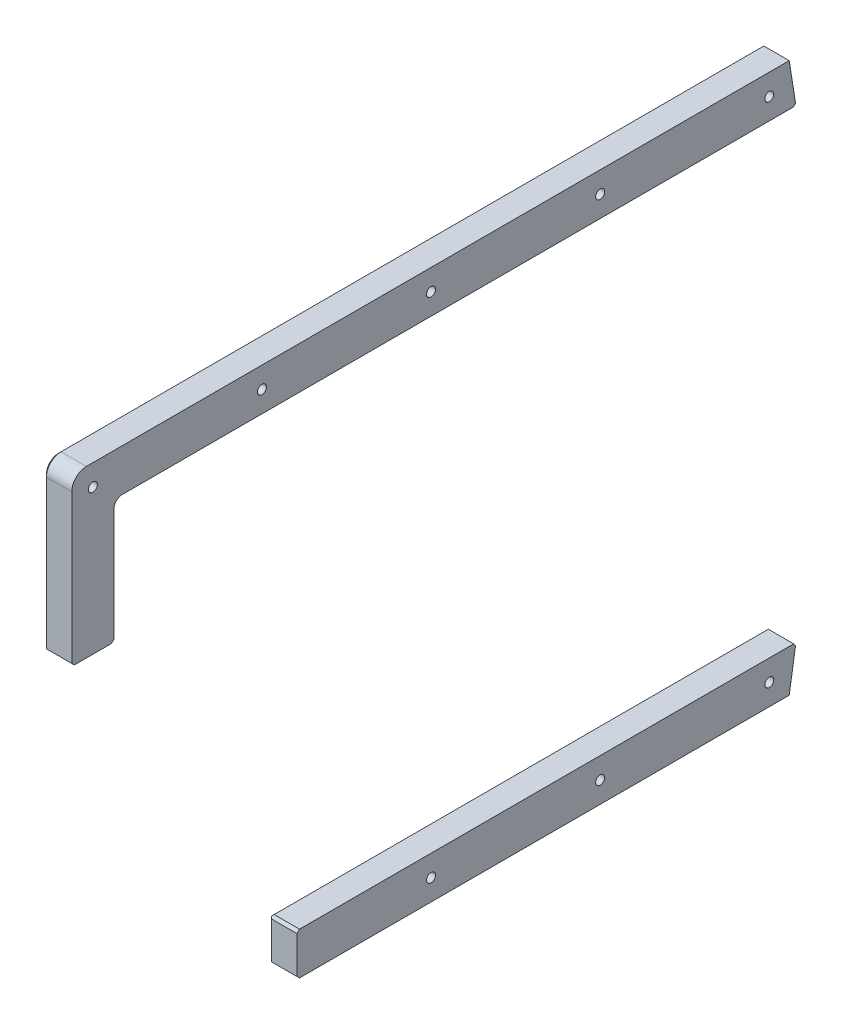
ISO-10303-21;
HEADER;
FILE_DESCRIPTION(('STEP AP214'),'2;1');
FILE_NAME('part.step','',(''),(''),'','','');
FILE_SCHEMA(('AUTOMOTIVE_DESIGN { 1 0 10303 214 1 1 1 1 }'));
ENDSEC;
DATA;
#1=APPLICATION_CONTEXT('core data for automotive mechanical design processes');
#2=APPLICATION_PROTOCOL_DEFINITION('international standard','automotive_design',2000,#1);
#3=PRODUCT_CONTEXT('',#1,'mechanical');
#4=PRODUCT('Part','Part','',(#3));
#5=PRODUCT_RELATED_PRODUCT_CATEGORY('part','',(#4));
#6=PRODUCT_DEFINITION_FORMATION('','',#4);
#7=PRODUCT_DEFINITION_CONTEXT('part definition',#1,'design');
#8=PRODUCT_DEFINITION('design','',#6,#7);
#9=PRODUCT_DEFINITION_SHAPE('','',#8);
#10=(LENGTH_UNIT() NAMED_UNIT(*) SI_UNIT(.MILLI.,.METRE.));
#11=(NAMED_UNIT(*) PLANE_ANGLE_UNIT() SI_UNIT($,.RADIAN.));
#12=(NAMED_UNIT(*) SI_UNIT($,.STERADIAN.) SOLID_ANGLE_UNIT());
#13=UNCERTAINTY_MEASURE_WITH_UNIT(LENGTH_MEASURE(1.E-05),#10,'distance_accuracy_value','');
#14=(GEOMETRIC_REPRESENTATION_CONTEXT(3) GLOBAL_UNCERTAINTY_ASSIGNED_CONTEXT((#13)) GLOBAL_UNIT_ASSIGNED_CONTEXT((#10,
#11,#12)) REPRESENTATION_CONTEXT('',''));
#15=CARTESIAN_POINT('',(0.,0.,0.));
#16=DIRECTION('',(0.,0.,1.));
#17=DIRECTION('',(1.,0.,0.));
#18=AXIS2_PLACEMENT_3D('',#15,#16,#17);
#19=CARTESIAN_POINT('',(0.,-44.7506615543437,-62.176880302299));
#20=DIRECTION('',(0.,0.,-1.));
#21=DIRECTION('',(-1.,0.,0.));
#22=AXIS2_PLACEMENT_3D('',#19,#20,#21);
#23=PLANE('',#22);
#24=DIRECTION('',(0.,-1.,0.));
#25=VECTOR('',#24,1.);
#26=CARTESIAN_POINT('',(8.382,103.255138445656,-62.176880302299));
#27=LINE('',#26,#25);
#28=CARTESIAN_POINT('',(8.382,-45.5126615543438,-62.176880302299));
#29=VERTEX_POINT('',#28);
#30=CARTESIAN_POINT('',(8.382,-56.6886615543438,-62.176880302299));
#31=VERTEX_POINT('',#30);
#32=EDGE_CURVE('E187',#29,#31,#27,.T.);
#33=ORIENTED_EDGE('',*,*,#32,.F.);
#34=DIRECTION('',(-1.,0.,0.));
#35=VECTOR('',#34,1.);
#36=CARTESIAN_POINT('',(0.,-45.5126615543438,-62.176880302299));
#37=LINE('',#36,#35);
#38=CARTESIAN_POINT('',(0.761999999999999,-45.5126615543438,-62.176880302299));
#39=VERTEX_POINT('',#38);
#40=EDGE_CURVE('E220',#29,#39,#37,.T.);
#41=ORIENTED_EDGE('',*,*,#40,.T.);
#42=DIRECTION('',(0.,-1.,0.));
#43=VECTOR('',#42,1.);
#44=CARTESIAN_POINT('',(0.761999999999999,-56.6886615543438,-62.176880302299));
#45=LINE('',#44,#43);
#46=CARTESIAN_POINT('',(0.761999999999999,-56.6886615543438,-62.176880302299));
#47=VERTEX_POINT('',#46);
#48=EDGE_CURVE('E218',#39,#47,#45,.T.);
#49=ORIENTED_EDGE('',*,*,#48,.T.);
#50=DIRECTION('',(1.,0.,0.));
#51=VECTOR('',#50,1.);
#52=CARTESIAN_POINT('',(0.,-56.6886615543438,-62.176880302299));
#53=LINE('',#52,#51);
#54=EDGE_CURVE('E216',#47,#31,#53,.T.);
#55=ORIENTED_EDGE('',*,*,#54,.T.);
#56=EDGE_LOOP('',(#33,#41,#49,#55));
#57=FACE_BOUND('',#56,.T.);
#58=ADVANCED_FACE('F49',(#57),#23,.F.);
#59=CARTESIAN_POINT('',(8.382,-51.1006615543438,-153.268880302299));
#60=DIRECTION('',(-1.,0.,0.));
#61=DIRECTION('',(0.,0.,1.));
#62=AXIS2_PLACEMENT_3D('',#59,#60,#61);
#63=CYLINDRICAL_SURFACE('',#62,1.35255);
#64=CARTESIAN_POINT('',(8.382,-51.1006615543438,-153.268880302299));
#65=DIRECTION('',(1.,0.,0.));
#66=DIRECTION('',(0.,0.,-1.));
#67=AXIS2_PLACEMENT_3D('',#64,#65,#66);
#68=CIRCLE('',#67,1.35255);
#69=CARTESIAN_POINT('',(8.382,-51.1006615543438,-154.621430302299));
#70=VERTEX_POINT('',#69);
#71=EDGE_CURVE('E196',#70,#70,#68,.T.);
#72=ORIENTED_EDGE('',*,*,#71,.T.);
#73=EDGE_LOOP('',(#72));
#74=FACE_BOUND('',#73,.T.);
#75=CARTESIAN_POINT('',(0.,-51.1006615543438,-153.268880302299));
#76=DIRECTION('',(1.,0.,0.));
#77=DIRECTION('',(0.,0.,-1.));
#78=AXIS2_PLACEMENT_3D('',#75,#76,#77);
#79=CIRCLE('',#78,1.35255);
#80=CARTESIAN_POINT('',(0.,-51.1006615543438,-154.621430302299));
#81=VERTEX_POINT('',#80);
#82=EDGE_CURVE('E191',#81,#81,#79,.T.);
#83=ORIENTED_EDGE('',*,*,#82,.F.);
#84=EDGE_LOOP('',(#83));
#85=FACE_BOUND('',#84,.T.);
#86=ADVANCED_FACE('F275',(#74,#85),#63,.F.);
#87=CARTESIAN_POINT('',(8.382,-51.1006615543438,-204.068880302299));
#88=DIRECTION('',(-1.,0.,0.));
#89=DIRECTION('',(0.,0.,1.));
#90=AXIS2_PLACEMENT_3D('',#87,#88,#89);
#91=CYLINDRICAL_SURFACE('',#90,1.35255);
#92=CARTESIAN_POINT('',(8.382,-51.1006615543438,-204.068880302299));
#93=DIRECTION('',(1.,0.,0.));
#94=DIRECTION('',(0.,0.,-1.));
#95=AXIS2_PLACEMENT_3D('',#92,#93,#94);
#96=CIRCLE('',#95,1.35255);
#97=CARTESIAN_POINT('',(8.382,-51.1006615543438,-205.421430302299));
#98=VERTEX_POINT('',#97);
#99=EDGE_CURVE('E199',#98,#98,#96,.T.);
#100=ORIENTED_EDGE('',*,*,#99,.T.);
#101=EDGE_LOOP('',(#100));
#102=FACE_BOUND('',#101,.T.);
#103=CARTESIAN_POINT('',(0.,-51.1006615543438,-204.068880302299));
#104=DIRECTION('',(1.,0.,0.));
#105=DIRECTION('',(0.,0.,-1.));
#106=AXIS2_PLACEMENT_3D('',#103,#104,#105);
#107=CIRCLE('',#106,1.35255);
#108=CARTESIAN_POINT('',(0.,-51.1006615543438,-205.421430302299));
#109=VERTEX_POINT('',#108);
#110=EDGE_CURVE('E195',#109,#109,#107,.T.);
#111=ORIENTED_EDGE('',*,*,#110,.F.);
#112=EDGE_LOOP('',(#111));
#113=FACE_BOUND('',#112,.T.);
#114=ADVANCED_FACE('F280',(#102,#113),#91,.F.);
#115=CARTESIAN_POINT('',(8.382,-51.1006615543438,-102.468880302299));
#116=DIRECTION('',(-1.,0.,0.));
#117=DIRECTION('',(0.,0.,1.));
#118=AXIS2_PLACEMENT_3D('',#115,#116,#117);
#119=CYLINDRICAL_SURFACE('',#118,1.35255);
#120=CARTESIAN_POINT('',(8.382,-51.1006615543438,-102.468880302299));
#121=DIRECTION('',(1.,0.,0.));
#122=DIRECTION('',(0.,0.,-1.));
#123=AXIS2_PLACEMENT_3D('',#120,#121,#122);
#124=CIRCLE('',#123,1.35255);
#125=CARTESIAN_POINT('',(8.382,-51.1006615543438,-103.821430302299));
#126=VERTEX_POINT('',#125);
#127=EDGE_CURVE('E139',#126,#126,#124,.T.);
#128=ORIENTED_EDGE('',*,*,#127,.T.);
#129=EDGE_LOOP('',(#128));
#130=FACE_BOUND('',#129,.T.);
#131=CARTESIAN_POINT('',(0.,-51.1006615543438,-102.468880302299));
#132=DIRECTION('',(1.,0.,0.));
#133=DIRECTION('',(0.,0.,-1.));
#134=AXIS2_PLACEMENT_3D('',#131,#132,#133);
#135=CIRCLE('',#134,1.35255);
#136=CARTESIAN_POINT('',(0.,-51.1006615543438,-103.821430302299));
#137=VERTEX_POINT('',#136);
#138=EDGE_CURVE('E181',#137,#137,#135,.T.);
#139=ORIENTED_EDGE('',*,*,#138,.F.);
#140=EDGE_LOOP('',(#139));
#141=FACE_BOUND('',#140,.T.);
#142=ADVANCED_FACE('F284',(#130,#141),#119,.F.);
#143=CARTESIAN_POINT('',(8.382,-44.7506615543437,-211.40976580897));
#144=DIRECTION('',(0.,-0.587724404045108,0.809061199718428));
#145=DIRECTION('',(-1.,0.,0.));
#146=AXIS2_PLACEMENT_3D('',#143,#144,#145);
#147=PLANE('',#146);
#148=DIRECTION('',(0.,-0.809061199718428,-0.587724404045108));
#149=VECTOR('',#148,1.);
#150=CARTESIAN_POINT('',(8.382,-44.7506615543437,-211.40976580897));
#151=LINE('',#150,#149);
#152=CARTESIAN_POINT('',(8.382,-45.5032711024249,-211.956482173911));
#153=VERTEX_POINT('',#152);
#154=CARTESIAN_POINT('',(8.382,-44.7506615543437,-211.40976580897));
#155=VERTEX_POINT('',#154);
#156=EDGE_CURVE('E149',#153,#155,#151,.F.);
#157=ORIENTED_EDGE('',*,*,#156,.F.);
#158=DIRECTION('',(1.,0.,0.));
#159=VECTOR('',#158,1.);
#160=CARTESIAN_POINT('',(8.382,-45.5032711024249,-211.956482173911));
#161=LINE('',#160,#159);
#162=CARTESIAN_POINT('',(0.762000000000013,-45.5032711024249,-211.956482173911));
#163=VERTEX_POINT('',#162);
#164=EDGE_CURVE('E131',#163,#153,#161,.T.);
#165=ORIENTED_EDGE('',*,*,#164,.F.);
#166=DIRECTION('',(0.,0.809061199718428,0.587724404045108));
#167=VECTOR('',#166,1.);
#168=CARTESIAN_POINT('',(0.762000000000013,-44.7506615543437,-211.40976580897));
#169=LINE('',#168,#167);
#170=CARTESIAN_POINT('',(0.762000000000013,-44.7506615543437,-211.40976580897));
#171=VERTEX_POINT('',#170);
#172=EDGE_CURVE('E147',#171,#163,#169,.F.);
#173=ORIENTED_EDGE('',*,*,#172,.F.);
#174=DIRECTION('',(-1.,0.,0.));
#175=VECTOR('',#174,1.);
#176=CARTESIAN_POINT('',(8.382,-44.7506615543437,-211.40976580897));
#177=LINE('',#176,#175);
#178=EDGE_CURVE('E171',#155,#171,#177,.T.);
#179=ORIENTED_EDGE('',*,*,#178,.F.);
#180=EDGE_LOOP('',(#157,#165,#173,#179));
#181=FACE_BOUND('',#180,.T.);
#182=ADVANCED_FACE('F144',(#181),#147,.F.);
#183=CARTESIAN_POINT('',(8.382,-57.4506615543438,-210.063280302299));
#184=DIRECTION('',(0.,0.156508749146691,0.987676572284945));
#185=DIRECTION('',(0.,-0.987676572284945,0.156508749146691));
#186=AXIS2_PLACEMENT_3D('',#183,#184,#185);
#187=PLANE('',#186);
#188=DIRECTION('',(0.,0.987676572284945,-0.156508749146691));
#189=VECTOR('',#188,1.);
#190=CARTESIAN_POINT('',(0.762000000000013,-44.7506615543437,-212.07574184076));
#191=LINE('',#190,#189);
#192=CARTESIAN_POINT('',(0.762000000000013,-57.4506615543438,-210.063280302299));
#193=VERTEX_POINT('',#192);
#194=EDGE_CURVE('E127',#193,#163,#191,.T.);
#195=ORIENTED_EDGE('',*,*,#194,.T.);
#196=ORIENTED_EDGE('',*,*,#164,.T.);
#197=DIRECTION('',(0.,0.987676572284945,-0.156508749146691));
#198=VECTOR('',#197,1.);
#199=CARTESIAN_POINT('',(8.382,-57.4506615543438,-210.063280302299));
#200=LINE('',#199,#198);
#201=CARTESIAN_POINT('',(8.382,-57.4506615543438,-210.063280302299));
#202=VERTEX_POINT('',#201);
#203=EDGE_CURVE('E183',#202,#153,#200,.T.);
#204=ORIENTED_EDGE('',*,*,#203,.F.);
#205=DIRECTION('',(-1.,0.,0.));
#206=VECTOR('',#205,1.);
#207=CARTESIAN_POINT('',(8.382,-57.4506615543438,-210.063280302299));
#208=LINE('',#207,#206);
#209=EDGE_CURVE('E134',#202,#193,#208,.T.);
#210=ORIENTED_EDGE('',*,*,#209,.T.);
#211=EDGE_LOOP('',(#195,#196,#204,#210));
#212=FACE_BOUND('',#211,.T.);
#213=ADVANCED_FACE('F129',(#212),#187,.F.);
#214=CARTESIAN_POINT('',(0.762000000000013,-57.4506615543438,-210.063280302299));
#215=DIRECTION('',(-0.707106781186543,-0.11066839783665,-0.698392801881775));
#216=DIRECTION('',(0.,-0.987676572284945,0.156508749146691));
#217=AXIS2_PLACEMENT_3D('',#214,#215,#216);
#218=PLANE('',#217);
#219=DIRECTION('',(-0.701997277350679,-0.00865101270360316,0.71212708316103));
#220=VECTOR('',#219,1.);
#221=CARTESIAN_POINT('',(0.493260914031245,-45.506582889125,-211.683865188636));
#222=LINE('',#221,#220);
#223=CARTESIAN_POINT('',(0.,-45.5126615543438,-211.183486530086));
#224=VERTEX_POINT('',#223);
#225=EDGE_CURVE('E153',#163,#224,#222,.T.);
#226=ORIENTED_EDGE('',*,*,#225,.F.);
#227=ORIENTED_EDGE('',*,*,#194,.F.);
#228=DIRECTION('',(0.605300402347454,-0.605300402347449,-0.516936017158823));
#229=VECTOR('',#228,1.);
#230=CARTESIAN_POINT('',(-65.2992833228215,8.61062176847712,-153.645910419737));
#231=LINE('',#230,#229);
#232=CARTESIAN_POINT('',(0.,-56.6886615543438,-209.41252037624));
#233=VERTEX_POINT('',#232);
#234=EDGE_CURVE('E158',#233,#193,#231,.T.);
#235=ORIENTED_EDGE('',*,*,#234,.F.);
#236=DIRECTION('',(0.,-0.987676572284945,0.156508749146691));
#237=VECTOR('',#236,1.);
#238=CARTESIAN_POINT('',(0.,-57.331401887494,-209.310670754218));
#239=LINE('',#238,#237);
#240=EDGE_CURVE('E155',#224,#233,#239,.T.);
#241=ORIENTED_EDGE('',*,*,#240,.F.);
#242=EDGE_LOOP('',(#226,#227,#235,#241));
#243=FACE_BOUND('',#242,.T.);
#244=ADVANCED_FACE('F154',(#243),#218,.T.);
#245=CARTESIAN_POINT('',(0.762000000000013,-44.7506615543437,-211.40976580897));
#246=DIRECTION('',(-0.637747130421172,0.452692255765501,-0.623175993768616));
#247=DIRECTION('',(-0.69888884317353,0.,0.715230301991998));
#248=AXIS2_PLACEMENT_3D('',#245,#246,#247);
#249=PLANE('',#248);
#250=ORIENTED_EDGE('',*,*,#172,.T.);
#251=ORIENTED_EDGE('',*,*,#225,.T.);
#252=DIRECTION('',(0.692015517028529,0.692015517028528,-0.205497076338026));
#253=VECTOR('',#252,1.);
#254=CARTESIAN_POINT('',(0.762000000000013,-44.7506615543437,-211.40976580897));
#255=LINE('',#254,#253);
#256=EDGE_CURVE('E161',#171,#224,#255,.F.);
#257=ORIENTED_EDGE('',*,*,#256,.F.);
#258=EDGE_LOOP('',(#250,#251,#257));
#259=FACE_BOUND('',#258,.T.);
#260=ADVANCED_FACE('F160',(#259),#249,.T.);
#261=CARTESIAN_POINT('',(0.762000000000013,-57.4506615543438,1.0615196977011));
#262=DIRECTION('',(-0.707106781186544,-0.707106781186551,0.));
#263=DIRECTION('',(0.,0.,1.));
#264=AXIS2_PLACEMENT_3D('',#261,#262,#263);
#265=PLANE('',#264);
#266=DIRECTION('',(0.577350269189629,-0.577350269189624,-0.577350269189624));
#267=VECTOR('',#266,1.);
#268=CARTESIAN_POINT('',(-20.5714666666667,-36.1171948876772,-41.6054136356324));
#269=LINE('',#268,#267);
#270=CARTESIAN_POINT('',(0.762000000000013,-57.4506615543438,-62.938880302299));
#271=VERTEX_POINT('',#270);
#272=CARTESIAN_POINT('',(0.38100000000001,-57.0696615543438,-62.5578803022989));
#273=VERTEX_POINT('',#272);
#274=EDGE_CURVE('E66',#271,#273,#269,.F.);
#275=ORIENTED_EDGE('',*,*,#274,.T.);
#276=DIRECTION('',(-0.577350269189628,0.577350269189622,-0.577350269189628));
#277=VECTOR('',#276,1.);
#278=CARTESIAN_POINT('',(21.8414666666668,-78.5301282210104,-41.0974136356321));
#279=LINE('',#278,#277);
#280=CARTESIAN_POINT('',(0.,-56.6886615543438,-62.938880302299));
#281=VERTEX_POINT('',#280);
#282=EDGE_CURVE('E58',#273,#281,#279,.T.);
#283=ORIENTED_EDGE('',*,*,#282,.T.);
#284=DIRECTION('',(0.,0.,1.));
#285=VECTOR('',#284,1.);
#286=CARTESIAN_POINT('',(0.,-56.6886615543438,1.0615196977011));
#287=LINE('',#286,#285);
#288=EDGE_CURVE('E178',#233,#281,#287,.T.);
#289=ORIENTED_EDGE('',*,*,#288,.F.);
#290=ORIENTED_EDGE('',*,*,#234,.T.);
#291=DIRECTION('',(0.,0.,-1.));
#292=VECTOR('',#291,1.);
#293=CARTESIAN_POINT('',(0.762000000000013,-57.4506615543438,-210.063280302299));
#294=LINE('',#293,#292);
#295=EDGE_CURVE('E169',#271,#193,#294,.T.);
#296=ORIENTED_EDGE('',*,*,#295,.F.);
#297=EDGE_LOOP('',(#275,#283,#289,#290,#296));
#298=FACE_BOUND('',#297,.T.);
#299=ADVANCED_FACE('F262',(#298),#265,.T.);
#300=CARTESIAN_POINT('',(8.382,-57.4506615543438,1.0615196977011));
#301=DIRECTION('',(0.,1.,0.));
#302=DIRECTION('',(0.,0.,1.));
#303=AXIS2_PLACEMENT_3D('',#300,#301,#302);
#304=PLANE('',#303);
#305=DIRECTION('',(0.,0.,-1.));
#306=VECTOR('',#305,1.);
#307=CARTESIAN_POINT('',(8.382,-57.4506615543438,1.0615196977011));
#308=LINE('',#307,#306);
#309=CARTESIAN_POINT('',(8.382,-57.4506615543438,-62.938880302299));
#310=VERTEX_POINT('',#309);
#311=EDGE_CURVE('E185',#310,#202,#308,.T.);
#312=ORIENTED_EDGE('',*,*,#311,.F.);
#313=DIRECTION('',(-1.,0.,0.));
#314=VECTOR('',#313,1.);
#315=CARTESIAN_POINT('',(8.382,-57.4506615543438,-62.938880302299));
#316=LINE('',#315,#314);
#317=EDGE_CURVE('E12',#310,#271,#316,.T.);
#318=ORIENTED_EDGE('',*,*,#317,.T.);
#319=ORIENTED_EDGE('',*,*,#295,.T.);
#320=ORIENTED_EDGE('',*,*,#209,.F.);
#321=EDGE_LOOP('',(#312,#318,#319,#320));
#322=FACE_BOUND('',#321,.T.);
#323=ADVANCED_FACE('F263',(#322),#304,.F.);
#324=CARTESIAN_POINT('',(0.762000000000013,-44.7506615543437,-212.07574184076));
#325=DIRECTION('',(-0.707106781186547,0.707106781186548,0.));
#326=DIRECTION('',(0.,0.,-1.));
#327=AXIS2_PLACEMENT_3D('',#324,#325,#326);
#328=PLANE('',#327);
#329=DIRECTION('',(0.577350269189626,0.577350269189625,0.577350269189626));
#330=VECTOR('',#329,1.);
#331=CARTESIAN_POINT('',(-49.2042871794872,-94.7169487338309,-112.143167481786));
#332=LINE('',#331,#330);
#333=CARTESIAN_POINT('',(0.,-45.5126615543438,-62.9388803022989));
#334=VERTEX_POINT('',#333);
#335=CARTESIAN_POINT('',(0.381000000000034,-45.1316615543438,-62.5578803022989));
#336=VERTEX_POINT('',#335);
#337=EDGE_CURVE('E222',#334,#336,#332,.T.);
#338=ORIENTED_EDGE('',*,*,#337,.T.);
#339=DIRECTION('',(-0.57735026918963,-0.577350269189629,0.577350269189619));
#340=VECTOR('',#339,1.);
#341=CARTESIAN_POINT('',(50.4742871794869,4.96162562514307,-112.651167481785));
#342=LINE('',#341,#340);
#343=CARTESIAN_POINT('',(0.762000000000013,-44.7506615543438,-62.9388803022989));
#344=VERTEX_POINT('',#343);
#345=EDGE_CURVE('E224',#336,#344,#342,.F.);
#346=ORIENTED_EDGE('',*,*,#345,.T.);
#347=DIRECTION('',(0.,0.,1.));
#348=VECTOR('',#347,1.);
#349=CARTESIAN_POINT('',(0.762000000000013,-44.7506615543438,-9.75888030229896));
#350=LINE('',#349,#348);
#351=EDGE_CURVE('E168',#171,#344,#350,.T.);
#352=ORIENTED_EDGE('',*,*,#351,.F.);
#353=ORIENTED_EDGE('',*,*,#256,.T.);
#354=DIRECTION('',(0.,0.,-1.));
#355=VECTOR('',#354,1.);
#356=CARTESIAN_POINT('',(0.,-45.5126615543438,-212.07574184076));
#357=LINE('',#356,#355);
#358=EDGE_CURVE('E173',#334,#224,#357,.T.);
#359=ORIENTED_EDGE('',*,*,#358,.F.);
#360=EDGE_LOOP('',(#338,#346,#352,#353,#359));
#361=FACE_BOUND('',#360,.T.);
#362=ADVANCED_FACE('F255',(#361),#328,.T.);
#363=CARTESIAN_POINT('',(8.382,-44.7506615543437,-212.07574184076));
#364=DIRECTION('',(0.,-1.,0.));
#365=DIRECTION('',(0.,0.,-1.));
#366=AXIS2_PLACEMENT_3D('',#363,#364,#365);
#367=PLANE('',#366);
#368=ORIENTED_EDGE('',*,*,#351,.T.);
#369=DIRECTION('',(1.,0.,0.));
#370=VECTOR('',#369,1.);
#371=CARTESIAN_POINT('',(8.382,-44.7506615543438,-62.9388803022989));
#372=LINE('',#371,#370);
#373=CARTESIAN_POINT('',(8.382,-44.7506615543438,-62.9388803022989));
#374=VERTEX_POINT('',#373);
#375=EDGE_CURVE('E182',#344,#374,#372,.T.);
#376=ORIENTED_EDGE('',*,*,#375,.T.);
#377=DIRECTION('',(0.,0.,1.));
#378=VECTOR('',#377,1.);
#379=CARTESIAN_POINT('',(8.382,-44.7506615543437,-212.07574184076));
#380=LINE('',#379,#378);
#381=EDGE_CURVE('E188',#155,#374,#380,.T.);
#382=ORIENTED_EDGE('',*,*,#381,.F.);
#383=ORIENTED_EDGE('',*,*,#178,.T.);
#384=EDGE_LOOP('',(#368,#376,#382,#383));
#385=FACE_BOUND('',#384,.T.);
#386=ADVANCED_FACE('F253',(#385),#367,.F.);
#387=CARTESIAN_POINT('',(0.,103.255138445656,1.0615196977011));
#388=DIRECTION('',(-1.,0.,0.));
#389=DIRECTION('',(0.,0.,1.));
#390=AXIS2_PLACEMENT_3D('',#387,#388,#389);
#391=PLANE('',#390);
#392=ORIENTED_EDGE('',*,*,#288,.T.);
#393=DIRECTION('',(0.,1.,0.));
#394=VECTOR('',#393,1.);
#395=CARTESIAN_POINT('',(0.,-45.5126615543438,-62.938880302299));
#396=LINE('',#395,#394);
#397=EDGE_CURVE('E226',#281,#334,#396,.T.);
#398=ORIENTED_EDGE('',*,*,#397,.T.);
#399=ORIENTED_EDGE('',*,*,#358,.T.);
#400=ORIENTED_EDGE('',*,*,#240,.T.);
#401=EDGE_LOOP('',(#392,#398,#399,#400));
#402=FACE_BOUND('',#401,.T.);
#403=ORIENTED_EDGE('',*,*,#138,.T.);
#404=EDGE_LOOP('',(#403));
#405=FACE_BOUND('',#404,.T.);
#406=ORIENTED_EDGE('',*,*,#110,.T.);
#407=EDGE_LOOP('',(#406));
#408=FACE_BOUND('',#407,.T.);
#409=ORIENTED_EDGE('',*,*,#82,.T.);
#410=EDGE_LOOP('',(#409));
#411=FACE_BOUND('',#410,.T.);
#412=ADVANCED_FACE('F259',(#402,#405,#408,#411),#391,.T.);
#413=CARTESIAN_POINT('',(8.382,103.255138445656,1.0615196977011));
#414=DIRECTION('',(-1.,0.,0.));
#415=DIRECTION('',(0.,0.,1.));
#416=AXIS2_PLACEMENT_3D('',#413,#414,#415);
#417=PLANE('',#416);
#418=ORIENTED_EDGE('',*,*,#381,.T.);
#419=DIRECTION('',(0.,0.707106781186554,-0.707106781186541));
#420=VECTOR('',#419,1.);
#421=CARTESIAN_POINT('',(8.382,-44.7506615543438,-62.9388803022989));
#422=LINE('',#421,#420);
#423=EDGE_CURVE('E214',#374,#29,#422,.F.);
#424=ORIENTED_EDGE('',*,*,#423,.T.);
#425=ORIENTED_EDGE('',*,*,#32,.T.);
#426=DIRECTION('',(0.,0.707106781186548,0.707106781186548));
#427=VECTOR('',#426,1.);
#428=CARTESIAN_POINT('',(8.382,-56.6886615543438,-62.176880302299));
#429=LINE('',#428,#427);
#430=EDGE_CURVE('E212',#31,#310,#429,.F.);
#431=ORIENTED_EDGE('',*,*,#430,.T.);
#432=ORIENTED_EDGE('',*,*,#311,.T.);
#433=ORIENTED_EDGE('',*,*,#203,.T.);
#434=ORIENTED_EDGE('',*,*,#156,.T.);
#435=EDGE_LOOP('',(#418,#424,#425,#431,#432,#433,#434));
#436=FACE_BOUND('',#435,.T.);
#437=ORIENTED_EDGE('',*,*,#71,.F.);
#438=EDGE_LOOP('',(#437));
#439=FACE_BOUND('',#438,.T.);
#440=ORIENTED_EDGE('',*,*,#99,.F.);
#441=EDGE_LOOP('',(#440));
#442=FACE_BOUND('',#441,.T.);
#443=ORIENTED_EDGE('',*,*,#127,.F.);
#444=EDGE_LOOP('',(#443));
#445=FACE_BOUND('',#444,.T.);
#446=ADVANCED_FACE('F247',(#436,#439,#442,#445),#417,.F.);
#447=CARTESIAN_POINT('',(0.,-56.6886615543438,-62.176880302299));
#448=DIRECTION('',(0.,0.707106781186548,-0.707106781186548));
#449=DIRECTION('',(1.,0.,0.));
#450=AXIS2_PLACEMENT_3D('',#447,#448,#449);
#451=PLANE('',#450);
#452=ORIENTED_EDGE('',*,*,#430,.F.);
#453=ORIENTED_EDGE('',*,*,#54,.F.);
#454=DIRECTION('',(0.577350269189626,0.577350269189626,0.577350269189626));
#455=VECTOR('',#454,1.);
#456=CARTESIAN_POINT('',(0.507999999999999,-56.9426615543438,-62.430880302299));
#457=LINE('',#456,#455);
#458=EDGE_CURVE('E53',#273,#47,#457,.T.);
#459=ORIENTED_EDGE('',*,*,#458,.F.);
#460=ORIENTED_EDGE('',*,*,#274,.F.);
#461=ORIENTED_EDGE('',*,*,#317,.F.);
#462=EDGE_LOOP('',(#452,#453,#459,#460,#461));
#463=FACE_BOUND('',#462,.T.);
#464=ADVANCED_FACE('F51',(#463),#451,.F.);
#465=CARTESIAN_POINT('',(0.,103.255138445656,-62.938880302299));
#466=DIRECTION('',(-0.707106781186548,0.,0.707106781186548));
#467=DIRECTION('',(0.,-1.,0.));
#468=AXIS2_PLACEMENT_3D('',#465,#466,#467);
#469=PLANE('',#468);
#470=ORIENTED_EDGE('',*,*,#458,.T.);
#471=ORIENTED_EDGE('',*,*,#48,.F.);
#472=DIRECTION('',(0.577350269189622,-0.577350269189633,0.577350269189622));
#473=VECTOR('',#472,1.);
#474=CARTESIAN_POINT('',(-49.3352666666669,4.58460511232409,-112.274146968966));
#475=LINE('',#474,#473);
#476=EDGE_CURVE('E229',#336,#39,#475,.T.);
#477=ORIENTED_EDGE('',*,*,#476,.F.);
#478=ORIENTED_EDGE('',*,*,#337,.F.);
#479=ORIENTED_EDGE('',*,*,#397,.F.);
#480=ORIENTED_EDGE('',*,*,#282,.F.);
#481=EDGE_LOOP('',(#470,#471,#477,#478,#479,#480));
#482=FACE_BOUND('',#481,.T.);
#483=ADVANCED_FACE('F239',(#482),#469,.T.);
#484=CARTESIAN_POINT('',(8.382,-44.7506615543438,-62.9388803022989));
#485=DIRECTION('',(0.,-0.707106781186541,-0.707106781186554));
#486=DIRECTION('',(1.,0.,0.));
#487=AXIS2_PLACEMENT_3D('',#484,#485,#486);
#488=PLANE('',#487);
#489=ORIENTED_EDGE('',*,*,#476,.T.);
#490=ORIENTED_EDGE('',*,*,#40,.F.);
#491=ORIENTED_EDGE('',*,*,#423,.F.);
#492=ORIENTED_EDGE('',*,*,#375,.F.);
#493=ORIENTED_EDGE('',*,*,#345,.F.);
#494=EDGE_LOOP('',(#489,#490,#491,#492,#493));
#495=FACE_BOUND('',#494,.T.);
#496=ADVANCED_FACE('F251',(#495),#488,.F.);
#497=CLOSED_SHELL('',(#58,#86,#114,#142,#182,#213,#244,#260,#299,#323,#362,#386,#412,#446,#464,
#483,#496));
#498=MANIFOLD_SOLID_BREP('B2',#497);
#499=CARTESIAN_POINT('',(8.382,103.255138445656,1.0615196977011));
#500=DIRECTION('',(-1.,0.,0.));
#501=DIRECTION('',(0.,0.,1.));
#502=AXIS2_PLACEMENT_3D('',#499,#500,#501);
#503=PLANE('',#502);
#504=CARTESIAN_POINT('',(8.382,101.299338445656,-204.068880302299));
#505=DIRECTION('',(1.,0.,0.));
#506=DIRECTION('',(0.,0.,-1.));
#507=AXIS2_PLACEMENT_3D('',#504,#505,#506);
#508=CIRCLE('',#507,1.35255);
#509=CARTESIAN_POINT('',(8.382,101.299338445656,-205.421430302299));
#510=VERTEX_POINT('',#509);
#511=EDGE_CURVE('E730',#510,#510,#508,.T.);
#512=ORIENTED_EDGE('',*,*,#511,.F.);
#513=EDGE_LOOP('',(#512));
#514=FACE_BOUND('',#513,.T.);
#515=CARTESIAN_POINT('',(8.382,101.299338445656,-153.268880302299));
#516=DIRECTION('',(1.,0.,0.));
#517=DIRECTION('',(0.,0.,-1.));
#518=AXIS2_PLACEMENT_3D('',#515,#516,#517);
#519=CIRCLE('',#518,1.35255);
#520=CARTESIAN_POINT('',(8.382,101.299338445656,-154.621430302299));
#521=VERTEX_POINT('',#520);
#522=EDGE_CURVE('E736',#521,#521,#519,.T.);
#523=ORIENTED_EDGE('',*,*,#522,.F.);
#524=EDGE_LOOP('',(#523));
#525=FACE_BOUND('',#524,.T.);
#526=CARTESIAN_POINT('',(8.382,101.299338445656,-102.468880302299));
#527=DIRECTION('',(1.,0.,0.));
#528=DIRECTION('',(0.,0.,-1.));
#529=AXIS2_PLACEMENT_3D('',#526,#527,#528);
#530=CIRCLE('',#529,1.35255);
#531=CARTESIAN_POINT('',(8.382,101.299338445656,-103.821430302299));
#532=VERTEX_POINT('',#531);
#533=EDGE_CURVE('E742',#532,#532,#530,.T.);
#534=ORIENTED_EDGE('',*,*,#533,.F.);
#535=EDGE_LOOP('',(#534));
#536=FACE_BOUND('',#535,.T.);
#537=CARTESIAN_POINT('',(8.382,101.299338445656,-0.868880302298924));
#538=DIRECTION('',(1.,0.,0.));
#539=DIRECTION('',(0.,0.,-1.));
#540=AXIS2_PLACEMENT_3D('',#537,#538,#539);
#541=CIRCLE('',#540,1.35255);
#542=CARTESIAN_POINT('',(8.382,101.299338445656,-2.22143030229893));
#543=VERTEX_POINT('',#542);
#544=EDGE_CURVE('E748',#543,#543,#541,.T.);
#545=ORIENTED_EDGE('',*,*,#544,.F.);
#546=EDGE_LOOP('',(#545));
#547=FACE_BOUND('',#546,.T.);
#548=CARTESIAN_POINT('',(8.382,101.299338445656,-51.6688803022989));
#549=DIRECTION('',(1.,0.,0.));
#550=DIRECTION('',(0.,0.,-1.));
#551=AXIS2_PLACEMENT_3D('',#548,#549,#550);
#552=CIRCLE('',#551,1.35255);
#553=CARTESIAN_POINT('',(8.382,101.299338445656,-53.0214303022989));
#554=VERTEX_POINT('',#553);
#555=EDGE_CURVE('E756',#554,#554,#552,.T.);
#556=ORIENTED_EDGE('',*,*,#555,.F.);
#557=EDGE_LOOP('',(#556));
#558=FACE_BOUND('',#557,.T.);
#559=DIRECTION('',(0.,-1.,0.));
#560=VECTOR('',#559,1.);
#561=CARTESIAN_POINT('',(8.382,103.255138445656,5.45571969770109));
#562=LINE('',#561,#560);
#563=CARTESIAN_POINT('',(8.382,103.255138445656,5.45571969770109));
#564=VERTEX_POINT('',#563);
#565=CARTESIAN_POINT('',(8.382,58.5693384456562,5.45571969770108));
#566=VERTEX_POINT('',#565);
#567=EDGE_CURVE('E592',#564,#566,#562,.T.);
#568=ORIENTED_EDGE('',*,*,#567,.T.);
#569=DIRECTION('',(0.,0.707106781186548,0.707106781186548));
#570=VECTOR('',#569,1.);
#571=CARTESIAN_POINT('',(8.382,58.5693384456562,5.45571969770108));
#572=LINE('',#571,#570);
#573=CARTESIAN_POINT('',(8.382,57.8073384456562,4.69371969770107));
#574=VERTEX_POINT('',#573);
#575=EDGE_CURVE('E430',#566,#574,#572,.F.);
#576=ORIENTED_EDGE('',*,*,#575,.T.);
#577=DIRECTION('',(0.,0.,-1.));
#578=VECTOR('',#577,1.);
#579=CARTESIAN_POINT('',(8.382,57.8073384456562,1.06151969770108));
#580=LINE('',#579,#578);
#581=CARTESIAN_POINT('',(8.382,57.8073384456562,-6.45688030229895));
#582=VERTEX_POINT('',#581);
#583=EDGE_CURVE('E663',#574,#582,#580,.T.);
#584=ORIENTED_EDGE('',*,*,#583,.T.);
#585=DIRECTION('',(0.,-0.707106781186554,0.707106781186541));
#586=VECTOR('',#585,1.);
#587=CARTESIAN_POINT('',(8.382,57.8073384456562,-6.45688030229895));
#588=LINE('',#587,#586);
#589=CARTESIAN_POINT('',(8.382,58.5693384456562,-7.21888030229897));
#590=VERTEX_POINT('',#589);
#591=EDGE_CURVE('E441',#582,#590,#588,.F.);
#592=ORIENTED_EDGE('',*,*,#591,.T.);
#593=DIRECTION('',(0.,1.,0.));
#594=VECTOR('',#593,1.);
#595=CARTESIAN_POINT('',(8.382,-44.7506615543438,-7.21888030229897));
#596=LINE('',#595,#594);
#597=CARTESIAN_POINT('',(8.382,92.4093384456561,-7.21888030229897));
#598=VERTEX_POINT('',#597);
#599=EDGE_CURVE('E759',#590,#598,#596,.T.);
#600=ORIENTED_EDGE('',*,*,#599,.T.);
#601=CARTESIAN_POINT('',(8.382,92.4093384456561,-9.75888030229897));
#602=DIRECTION('',(-1.,0.,0.));
#603=DIRECTION('',(0.,0.,1.));
#604=AXIS2_PLACEMENT_3D('',#601,#602,#603);
#605=CIRCLE('',#604,2.54);
#606=CARTESIAN_POINT('',(8.382,94.9493384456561,-9.75888030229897));
#607=VERTEX_POINT('',#606);
#608=EDGE_CURVE('E611',#598,#607,#605,.T.);
#609=ORIENTED_EDGE('',*,*,#608,.T.);
#610=DIRECTION('',(0.,0.,-1.));
#611=VECTOR('',#610,1.);
#612=CARTESIAN_POINT('',(8.382,94.9493384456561,-7.21888030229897));
#613=LINE('',#612,#611);
#614=CARTESIAN_POINT('',(8.382,94.9493384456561,-211.31374184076));
#615=VERTEX_POINT('',#614);
#616=EDGE_CURVE('E571',#607,#615,#613,.T.);
#617=ORIENTED_EDGE('',*,*,#616,.T.);
#618=DIRECTION('',(0.,-0.707106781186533,0.707106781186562));
#619=VECTOR('',#618,1.);
#620=CARTESIAN_POINT('',(8.382,95.6071073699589,-211.971510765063));
#621=LINE('',#620,#619);
#622=CARTESIAN_POINT('',(8.382,95.6071073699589,-211.971510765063));
#623=VERTEX_POINT('',#622);
#624=EDGE_CURVE('E567',#615,#623,#621,.F.);
#625=ORIENTED_EDGE('',*,*,#624,.T.);
#626=DIRECTION('',(0.,0.987676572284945,0.156508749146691));
#627=VECTOR('',#626,1.);
#628=CARTESIAN_POINT('',(8.382,94.9493384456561,-212.07574184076));
#629=LINE('',#628,#627);
#630=CARTESIAN_POINT('',(8.382,107.649338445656,-210.063280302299));
#631=VERTEX_POINT('',#630);
#632=EDGE_CURVE('E560',#623,#631,#629,.T.);
#633=ORIENTED_EDGE('',*,*,#632,.T.);
#634=DIRECTION('',(0.,0.,1.));
#635=VECTOR('',#634,1.);
#636=CARTESIAN_POINT('',(8.382,107.649338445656,-210.063280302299));
#637=LINE('',#636,#635);
#638=CARTESIAN_POINT('',(8.382,107.649338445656,1.0615196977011));
#639=VERTEX_POINT('',#638);
#640=EDGE_CURVE('E563',#631,#639,#637,.T.);
#641=ORIENTED_EDGE('',*,*,#640,.T.);
#642=CARTESIAN_POINT('',(8.382,103.255138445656,1.0615196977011));
#643=DIRECTION('',(1.,0.,0.));
#644=DIRECTION('',(0.,0.,1.));
#645=AXIS2_PLACEMENT_3D('',#642,#643,#644);
#646=CIRCLE('',#645,4.39419999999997);
#647=EDGE_CURVE('E587',#639,#564,#646,.T.);
#648=ORIENTED_EDGE('',*,*,#647,.T.);
#649=EDGE_LOOP('',(#568,#576,#584,#592,#600,#609,#617,#625,#633,#641,#648));
#650=FACE_BOUND('',#649,.T.);
#651=ADVANCED_FACE('F420',(#514,#525,#536,#547,#558,#650),#503,.F.);
#652=CARTESIAN_POINT('',(0.,103.255138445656,1.0615196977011));
#653=DIRECTION('',(-1.,0.,0.));
#654=DIRECTION('',(0.,0.,1.));
#655=AXIS2_PLACEMENT_3D('',#652,#653,#654);
#656=PLANE('',#655);
#657=DIRECTION('',(0.,-1.,0.));
#658=VECTOR('',#657,1.);
#659=CARTESIAN_POINT('',(0.,-42.2106615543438,-6.45688030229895));
#660=LINE('',#659,#658);
#661=CARTESIAN_POINT('',(0.,92.4093384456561,-6.45688030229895));
#662=VERTEX_POINT('',#661);
#663=CARTESIAN_POINT('',(0.,58.5693384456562,-6.45688030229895));
#664=VERTEX_POINT('',#663);
#665=EDGE_CURVE('E626',#662,#664,#660,.T.);
#666=ORIENTED_EDGE('',*,*,#665,.T.);
#667=DIRECTION('',(0.,0.,1.));
#668=VECTOR('',#667,1.);
#669=CARTESIAN_POINT('',(0.,58.5693384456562,4.69371969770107));
#670=LINE('',#669,#668);
#671=CARTESIAN_POINT('',(0.,58.5693384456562,4.69371969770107));
#672=VERTEX_POINT('',#671);
#673=EDGE_CURVE('E659',#664,#672,#670,.T.);
#674=ORIENTED_EDGE('',*,*,#673,.T.);
#675=DIRECTION('',(0.,1.,0.));
#676=VECTOR('',#675,1.);
#677=CARTESIAN_POINT('',(0.,103.255138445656,4.69371969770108));
#678=LINE('',#677,#676);
#679=CARTESIAN_POINT('',(0.,103.255138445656,4.69371969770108));
#680=VERTEX_POINT('',#679);
#681=EDGE_CURVE('E623',#672,#680,#678,.T.);
#682=ORIENTED_EDGE('',*,*,#681,.T.);
#683=CARTESIAN_POINT('',(0.,103.255138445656,1.0615196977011));
#684=DIRECTION('',(-1.,0.,0.));
#685=DIRECTION('',(0.,0.,1.));
#686=AXIS2_PLACEMENT_3D('',#683,#684,#685);
#687=CIRCLE('',#686,3.63219999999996);
#688=CARTESIAN_POINT('',(0.,106.887338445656,1.0615196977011));
#689=VERTEX_POINT('',#688);
#690=EDGE_CURVE('E630',#680,#689,#687,.T.);
#691=ORIENTED_EDGE('',*,*,#690,.T.);
#692=DIRECTION('',(0.,0.,-1.));
#693=VECTOR('',#692,1.);
#694=CARTESIAN_POINT('',(0.,106.887338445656,-210.063280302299));
#695=LINE('',#694,#693);
#696=CARTESIAN_POINT('',(0.,106.887338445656,-209.41252037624));
#697=VERTEX_POINT('',#696);
#698=EDGE_CURVE('E636',#689,#697,#695,.T.);
#699=ORIENTED_EDGE('',*,*,#698,.T.);
#700=DIRECTION('',(0.,-0.987676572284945,-0.156508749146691));
#701=VECTOR('',#700,1.);
#702=CARTESIAN_POINT('',(0.,94.8300787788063,-211.323132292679));
#703=LINE('',#702,#701);
#704=CARTESIAN_POINT('',(0.,95.7113384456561,-211.183486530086));
#705=VERTEX_POINT('',#704);
#706=EDGE_CURVE('E641',#697,#705,#703,.T.);
#707=ORIENTED_EDGE('',*,*,#706,.T.);
#708=DIRECTION('',(0.,0.,1.));
#709=VECTOR('',#708,1.);
#710=CARTESIAN_POINT('',(0.,95.7113384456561,-9.75888030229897));
#711=LINE('',#710,#709);
#712=CARTESIAN_POINT('',(0.,95.7113384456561,-9.75888030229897));
#713=VERTEX_POINT('',#712);
#714=EDGE_CURVE('E638',#705,#713,#711,.T.);
#715=ORIENTED_EDGE('',*,*,#714,.T.);
#716=CARTESIAN_POINT('',(0.,92.4093384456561,-9.75888030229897));
#717=DIRECTION('',(-1.,0.,0.));
#718=DIRECTION('',(0.,0.,1.));
#719=AXIS2_PLACEMENT_3D('',#716,#717,#718);
#720=CIRCLE('',#719,3.30200000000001);
#721=EDGE_CURVE('E633',#713,#662,#720,.F.);
#722=ORIENTED_EDGE('',*,*,#721,.T.);
#723=EDGE_LOOP('',(#666,#674,#682,#691,#699,#707,#715,#722));
#724=FACE_BOUND('',#723,.T.);
#725=CARTESIAN_POINT('',(0.,101.299338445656,-204.068880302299));
#726=DIRECTION('',(1.,0.,0.));
#727=DIRECTION('',(0.,0.,-1.));
#728=AXIS2_PLACEMENT_3D('',#725,#726,#727);
#729=CIRCLE('',#728,1.35255);
#730=CARTESIAN_POINT('',(0.,101.299338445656,-205.421430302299));
#731=VERTEX_POINT('',#730);
#732=EDGE_CURVE('E686',#731,#731,#729,.T.);
#733=ORIENTED_EDGE('',*,*,#732,.T.);
#734=EDGE_LOOP('',(#733));
#735=FACE_BOUND('',#734,.T.);
#736=CARTESIAN_POINT('',(0.,101.299338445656,-102.468880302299));
#737=DIRECTION('',(1.,0.,0.));
#738=DIRECTION('',(0.,0.,-1.));
#739=AXIS2_PLACEMENT_3D('',#736,#737,#738);
#740=CIRCLE('',#739,1.35255);
#741=CARTESIAN_POINT('',(0.,101.299338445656,-103.821430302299));
#742=VERTEX_POINT('',#741);
#743=EDGE_CURVE('E739',#742,#742,#740,.T.);
#744=ORIENTED_EDGE('',*,*,#743,.T.);
#745=EDGE_LOOP('',(#744));
#746=FACE_BOUND('',#745,.T.);
#747=CARTESIAN_POINT('',(0.,101.299338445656,-51.6688803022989));
#748=DIRECTION('',(1.,0.,0.));
#749=DIRECTION('',(0.,0.,-1.));
#750=AXIS2_PLACEMENT_3D('',#747,#748,#749);
#751=CIRCLE('',#750,1.35255);
#752=CARTESIAN_POINT('',(0.,101.299338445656,-53.0214303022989));
#753=VERTEX_POINT('',#752);
#754=EDGE_CURVE('E752',#753,#753,#751,.T.);
#755=ORIENTED_EDGE('',*,*,#754,.T.);
#756=EDGE_LOOP('',(#755));
#757=FACE_BOUND('',#756,.T.);
#758=CARTESIAN_POINT('',(0.,101.299338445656,-0.868880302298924));
#759=DIRECTION('',(1.,0.,0.));
#760=DIRECTION('',(0.,0.,-1.));
#761=AXIS2_PLACEMENT_3D('',#758,#759,#760);
#762=CIRCLE('',#761,1.35255);
#763=CARTESIAN_POINT('',(0.,101.299338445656,-2.22143030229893));
#764=VERTEX_POINT('',#763);
#765=EDGE_CURVE('E745',#764,#764,#762,.T.);
#766=ORIENTED_EDGE('',*,*,#765,.T.);
#767=EDGE_LOOP('',(#766));
#768=FACE_BOUND('',#767,.T.);
#769=CARTESIAN_POINT('',(0.,101.299338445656,-153.268880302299));
#770=DIRECTION('',(1.,0.,0.));
#771=DIRECTION('',(0.,0.,-1.));
#772=AXIS2_PLACEMENT_3D('',#769,#770,#771);
#773=CIRCLE('',#772,1.35255);
#774=CARTESIAN_POINT('',(0.,101.299338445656,-154.621430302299));
#775=VERTEX_POINT('',#774);
#776=EDGE_CURVE('E733',#775,#775,#773,.T.);
#777=ORIENTED_EDGE('',*,*,#776,.T.);
#778=EDGE_LOOP('',(#777));
#779=FACE_BOUND('',#778,.T.);
#780=ADVANCED_FACE('F829',(#724,#735,#746,#757,#768,#779),#656,.T.);
#781=CARTESIAN_POINT('',(8.382,-44.7506615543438,-7.21888030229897));
#782=DIRECTION('',(0.,0.,1.));
#783=DIRECTION('',(1.,0.,0.));
#784=AXIS2_PLACEMENT_3D('',#781,#782,#783);
#785=PLANE('',#784);
#786=ORIENTED_EDGE('',*,*,#599,.F.);
#787=DIRECTION('',(-1.,0.,0.));
#788=VECTOR('',#787,1.);
#789=CARTESIAN_POINT('',(8.382,58.5693384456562,-7.21888030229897));
#790=LINE('',#789,#788);
#791=CARTESIAN_POINT('',(0.762000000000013,58.5693384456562,-7.21888030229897));
#792=VERTEX_POINT('',#791);
#793=EDGE_CURVE('E47',#590,#792,#790,.T.);
#794=ORIENTED_EDGE('',*,*,#793,.T.);
#795=DIRECTION('',(0.,1.,0.));
#796=VECTOR('',#795,1.);
#797=CARTESIAN_POINT('',(0.762000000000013,92.4093384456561,-7.21888030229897));
#798=LINE('',#797,#796);
#799=CARTESIAN_POINT('',(0.762000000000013,92.4093384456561,-7.21888030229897));
#800=VERTEX_POINT('',#799);
#801=EDGE_CURVE('E653',#792,#800,#798,.T.);
#802=ORIENTED_EDGE('',*,*,#801,.T.);
#803=DIRECTION('',(-1.,0.,0.));
#804=VECTOR('',#803,1.);
#805=CARTESIAN_POINT('',(8.382,92.4093384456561,-7.21888030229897));
#806=LINE('',#805,#804);
#807=EDGE_CURVE('E607',#800,#598,#806,.F.);
#808=ORIENTED_EDGE('',*,*,#807,.T.);
#809=EDGE_LOOP('',(#786,#794,#802,#808));
#810=FACE_BOUND('',#809,.T.);
#811=ADVANCED_FACE('F811',(#810),#785,.F.);
#812=CARTESIAN_POINT('',(8.382,94.9493384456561,-7.21888030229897));
#813=DIRECTION('',(0.,1.,0.));
#814=DIRECTION('',(0.,0.,1.));
#815=AXIS2_PLACEMENT_3D('',#812,#813,#814);
#816=PLANE('',#815);
#817=DIRECTION('',(0.,0.,-1.));
#818=VECTOR('',#817,1.);
#819=CARTESIAN_POINT('',(0.762000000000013,94.9493384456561,-212.07574184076));
#820=LINE('',#819,#818);
#821=CARTESIAN_POINT('',(0.762000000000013,94.9493384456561,-9.75888030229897));
#822=VERTEX_POINT('',#821);
#823=CARTESIAN_POINT('',(0.762000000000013,94.9493384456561,-211.31374184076));
#824=VERTEX_POINT('',#823);
#825=EDGE_CURVE('E617',#822,#824,#820,.T.);
#826=ORIENTED_EDGE('',*,*,#825,.T.);
#827=DIRECTION('',(1.,0.,0.));
#828=VECTOR('',#827,1.);
#829=CARTESIAN_POINT('',(8.382,94.9493384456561,-211.31374184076));
#830=LINE('',#829,#828);
#831=EDGE_CURVE('E620',#824,#615,#830,.T.);
#832=ORIENTED_EDGE('',*,*,#831,.T.);
#833=ORIENTED_EDGE('',*,*,#616,.F.);
#834=DIRECTION('',(-1.,0.,0.));
#835=VECTOR('',#834,1.);
#836=CARTESIAN_POINT('',(0.,94.9493384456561,-9.75888030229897));
#837=LINE('',#836,#835);
#838=EDGE_CURVE('E580',#607,#822,#837,.T.);
#839=ORIENTED_EDGE('',*,*,#838,.T.);
#840=EDGE_LOOP('',(#826,#832,#833,#839));
#841=FACE_BOUND('',#840,.T.);
#842=ADVANCED_FACE('F825',(#841),#816,.F.);
#843=CARTESIAN_POINT('',(8.382,94.9493384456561,-212.07574184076));
#844=DIRECTION('',(0.,-0.156508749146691,0.987676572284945));
#845=DIRECTION('',(0.,-0.987676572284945,-0.156508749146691));
#846=AXIS2_PLACEMENT_3D('',#843,#844,#845);
#847=PLANE('',#846);
#848=ORIENTED_EDGE('',*,*,#632,.F.);
#849=DIRECTION('',(-1.,0.,0.));
#850=VECTOR('',#849,1.);
#851=CARTESIAN_POINT('',(8.382,95.6071073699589,-211.971510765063));
#852=LINE('',#851,#850);
#853=CARTESIAN_POINT('',(0.762000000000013,95.6071073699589,-211.971510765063));
#854=VERTEX_POINT('',#853);
#855=EDGE_CURVE('E615',#623,#854,#852,.T.);
#856=ORIENTED_EDGE('',*,*,#855,.T.);
#857=DIRECTION('',(0.,0.987676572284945,0.156508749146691));
#858=VECTOR('',#857,1.);
#859=CARTESIAN_POINT('',(0.762000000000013,107.649338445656,-210.063280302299));
#860=LINE('',#859,#858);
#861=CARTESIAN_POINT('',(0.762000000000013,107.649338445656,-210.063280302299));
#862=VERTEX_POINT('',#861);
#863=EDGE_CURVE('E577',#854,#862,#860,.T.);
#864=ORIENTED_EDGE('',*,*,#863,.T.);
#865=DIRECTION('',(-1.,0.,0.));
#866=VECTOR('',#865,1.);
#867=CARTESIAN_POINT('',(8.382,107.649338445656,-210.063280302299));
#868=LINE('',#867,#866);
#869=EDGE_CURVE('E574',#631,#862,#868,.T.);
#870=ORIENTED_EDGE('',*,*,#869,.F.);
#871=EDGE_LOOP('',(#848,#856,#864,#870));
#872=FACE_BOUND('',#871,.T.);
#873=ADVANCED_FACE('F575',(#872),#847,.F.);
#874=CARTESIAN_POINT('',(8.382,107.649338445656,-210.063280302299));
#875=DIRECTION('',(0.,-1.,0.));
#876=DIRECTION('',(0.,0.,-1.));
#877=AXIS2_PLACEMENT_3D('',#874,#875,#876);
#878=PLANE('',#877);
#879=ORIENTED_EDGE('',*,*,#869,.T.);
#880=DIRECTION('',(0.,0.,1.));
#881=VECTOR('',#880,1.);
#882=CARTESIAN_POINT('',(0.762000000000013,107.649338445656,1.0615196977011));
#883=LINE('',#882,#881);
#884=CARTESIAN_POINT('',(0.762000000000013,107.649338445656,1.0615196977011));
#885=VERTEX_POINT('',#884);
#886=EDGE_CURVE('E644',#862,#885,#883,.T.);
#887=ORIENTED_EDGE('',*,*,#886,.T.);
#888=DIRECTION('',(-1.,0.,0.));
#889=VECTOR('',#888,1.);
#890=CARTESIAN_POINT('',(8.382,107.649338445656,1.0615196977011));
#891=LINE('',#890,#889);
#892=EDGE_CURVE('E581',#639,#885,#891,.T.);
#893=ORIENTED_EDGE('',*,*,#892,.F.);
#894=ORIENTED_EDGE('',*,*,#640,.F.);
#895=EDGE_LOOP('',(#879,#887,#893,#894));
#896=FACE_BOUND('',#895,.T.);
#897=ADVANCED_FACE('F583',(#896),#878,.F.);
#898=CARTESIAN_POINT('',(8.382,103.255138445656,1.0615196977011));
#899=DIRECTION('',(-1.,0.,0.));
#900=DIRECTION('',(0.,0.,1.));
#901=AXIS2_PLACEMENT_3D('',#898,#899,#900);
#902=CYLINDRICAL_SURFACE('',#901,4.39419999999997);
#903=ORIENTED_EDGE('',*,*,#892,.T.);
#904=CARTESIAN_POINT('',(0.762000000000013,103.255138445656,1.0615196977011));
#905=DIRECTION('',(-1.,0.,0.));
#906=DIRECTION('',(0.,0.,1.));
#907=AXIS2_PLACEMENT_3D('',#904,#905,#906);
#908=CIRCLE('',#907,4.39419999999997);
#909=CARTESIAN_POINT('',(0.762000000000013,103.255138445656,5.45571969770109));
#910=VERTEX_POINT('',#909);
#911=EDGE_CURVE('E650',#885,#910,#908,.F.);
#912=ORIENTED_EDGE('',*,*,#911,.T.);
#913=DIRECTION('',(-1.,0.,0.));
#914=VECTOR('',#913,1.);
#915=CARTESIAN_POINT('',(8.382,103.255138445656,5.45571969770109));
#916=LINE('',#915,#914);
#917=EDGE_CURVE('E598',#564,#910,#916,.T.);
#918=ORIENTED_EDGE('',*,*,#917,.F.);
#919=ORIENTED_EDGE('',*,*,#647,.F.);
#920=EDGE_LOOP('',(#903,#912,#918,#919));
#921=FACE_BOUND('',#920,.T.);
#922=ADVANCED_FACE('F787',(#921),#902,.T.);
#923=CARTESIAN_POINT('',(8.382,103.255138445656,5.45571969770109));
#924=DIRECTION('',(0.,0.,-1.));
#925=DIRECTION('',(0.,1.,0.));
#926=AXIS2_PLACEMENT_3D('',#923,#924,#925);
#927=PLANE('',#926);
#928=DIRECTION('',(0.,-1.,0.));
#929=VECTOR('',#928,1.);
#930=CARTESIAN_POINT('',(0.762000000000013,-53.0564615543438,5.45571969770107));
#931=LINE('',#930,#929);
#932=CARTESIAN_POINT('',(0.762000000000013,58.5693384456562,5.45571969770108));
#933=VERTEX_POINT('',#932);
#934=EDGE_CURVE('E656',#910,#933,#931,.T.);
#935=ORIENTED_EDGE('',*,*,#934,.T.);
#936=DIRECTION('',(1.,0.,0.));
#937=VECTOR('',#936,1.);
#938=CARTESIAN_POINT('',(8.382,58.5693384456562,5.45571969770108));
#939=LINE('',#938,#937);
#940=EDGE_CURVE('E452',#933,#566,#939,.T.);
#941=ORIENTED_EDGE('',*,*,#940,.T.);
#942=ORIENTED_EDGE('',*,*,#567,.F.);
#943=ORIENTED_EDGE('',*,*,#917,.T.);
#944=EDGE_LOOP('',(#935,#941,#942,#943));
#945=FACE_BOUND('',#944,.T.);
#946=ADVANCED_FACE('F798',(#945),#927,.F.);
#947=CARTESIAN_POINT('',(8.382,101.299338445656,-51.6688803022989));
#948=DIRECTION('',(-1.,0.,0.));
#949=DIRECTION('',(0.,0.,1.));
#950=AXIS2_PLACEMENT_3D('',#947,#948,#949);
#951=CYLINDRICAL_SURFACE('',#950,1.35255);
#952=ORIENTED_EDGE('',*,*,#555,.T.);
#953=EDGE_LOOP('',(#952));
#954=FACE_BOUND('',#953,.T.);
#955=ORIENTED_EDGE('',*,*,#754,.F.);
#956=EDGE_LOOP('',(#955));
#957=FACE_BOUND('',#956,.T.);
#958=ADVANCED_FACE('F849',(#954,#957),#951,.F.);
#959=CARTESIAN_POINT('',(8.382,101.299338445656,-0.868880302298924));
#960=DIRECTION('',(-1.,0.,0.));
#961=DIRECTION('',(0.,0.,1.));
#962=AXIS2_PLACEMENT_3D('',#959,#960,#961);
#963=CYLINDRICAL_SURFACE('',#962,1.35255);
#964=ORIENTED_EDGE('',*,*,#544,.T.);
#965=EDGE_LOOP('',(#964));
#966=FACE_BOUND('',#965,.T.);
#967=ORIENTED_EDGE('',*,*,#765,.F.);
#968=EDGE_LOOP('',(#967));
#969=FACE_BOUND('',#968,.T.);
#970=ADVANCED_FACE('F1005',(#966,#969),#963,.F.);
#971=CARTESIAN_POINT('',(8.382,101.299338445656,-102.468880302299));
#972=DIRECTION('',(-1.,0.,0.));
#973=DIRECTION('',(0.,0.,1.));
#974=AXIS2_PLACEMENT_3D('',#971,#972,#973);
#975=CYLINDRICAL_SURFACE('',#974,1.35255);
#976=ORIENTED_EDGE('',*,*,#533,.T.);
#977=EDGE_LOOP('',(#976));
#978=FACE_BOUND('',#977,.T.);
#979=ORIENTED_EDGE('',*,*,#743,.F.);
#980=EDGE_LOOP('',(#979));
#981=FACE_BOUND('',#980,.T.);
#982=ADVANCED_FACE('F996',(#978,#981),#975,.F.);
#983=CARTESIAN_POINT('',(8.382,101.299338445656,-153.268880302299));
#984=DIRECTION('',(-1.,0.,0.));
#985=DIRECTION('',(0.,0.,1.));
#986=AXIS2_PLACEMENT_3D('',#983,#984,#985);
#987=CYLINDRICAL_SURFACE('',#986,1.35255);
#988=ORIENTED_EDGE('',*,*,#522,.T.);
#989=EDGE_LOOP('',(#988));
#990=FACE_BOUND('',#989,.T.);
#991=ORIENTED_EDGE('',*,*,#776,.F.);
#992=EDGE_LOOP('',(#991));
#993=FACE_BOUND('',#992,.T.);
#994=ADVANCED_FACE('F986',(#990,#993),#987,.F.);
#995=CARTESIAN_POINT('',(8.382,101.299338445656,-204.068880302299));
#996=DIRECTION('',(-1.,0.,0.));
#997=DIRECTION('',(0.,0.,1.));
#998=AXIS2_PLACEMENT_3D('',#995,#996,#997);
#999=CYLINDRICAL_SURFACE('',#998,1.35255);
#1000=ORIENTED_EDGE('',*,*,#511,.T.);
#1001=EDGE_LOOP('',(#1000));
#1002=FACE_BOUND('',#1001,.T.);
#1003=ORIENTED_EDGE('',*,*,#732,.F.);
#1004=EDGE_LOOP('',(#1003));
#1005=FACE_BOUND('',#1004,.T.);
#1006=ADVANCED_FACE('F866',(#1002,#1005),#999,.F.);
#1007=CARTESIAN_POINT('',(8.382,92.4093384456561,-9.75888030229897));
#1008=DIRECTION('',(1.,0.,0.));
#1009=DIRECTION('',(0.,0.,-1.));
#1010=AXIS2_PLACEMENT_3D('',#1007,#1008,#1009);
#1011=CYLINDRICAL_SURFACE('',#1010,2.54);
#1012=ORIENTED_EDGE('',*,*,#807,.F.);
#1013=CARTESIAN_POINT('',(0.762000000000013,92.4093384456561,-9.75888030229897));
#1014=DIRECTION('',(-1.,0.,0.));
#1015=DIRECTION('',(0.,0.,1.));
#1016=AXIS2_PLACEMENT_3D('',#1013,#1014,#1015);
#1017=CIRCLE('',#1016,2.54);
#1018=EDGE_CURVE('E647',#800,#822,#1017,.T.);
#1019=ORIENTED_EDGE('',*,*,#1018,.T.);
#1020=ORIENTED_EDGE('',*,*,#838,.F.);
#1021=ORIENTED_EDGE('',*,*,#608,.F.);
#1022=EDGE_LOOP('',(#1012,#1019,#1020,#1021));
#1023=FACE_BOUND('',#1022,.T.);
#1024=ADVANCED_FACE('F824',(#1023),#1011,.F.);
#1025=CARTESIAN_POINT('',(0.762000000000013,103.255138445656,5.45571969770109));
#1026=DIRECTION('',(-0.707106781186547,0.,0.707106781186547));
#1027=DIRECTION('',(0.,1.,0.));
#1028=AXIS2_PLACEMENT_3D('',#1025,#1026,#1027);
#1029=PLANE('',#1028);
#1030=ORIENTED_EDGE('',*,*,#681,.F.);
#1031=DIRECTION('',(0.577350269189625,-0.577350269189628,0.577350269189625));
#1032=VECTOR('',#1031,1.);
#1033=CARTESIAN_POINT('',(-14.3872666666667,72.956605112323,-9.69354696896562));
#1034=LINE('',#1033,#1032);
#1035=CARTESIAN_POINT('',(0.381000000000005,58.1883384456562,5.07471969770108));
#1036=VERTEX_POINT('',#1035);
#1037=EDGE_CURVE('E693',#672,#1036,#1034,.T.);
#1038=ORIENTED_EDGE('',*,*,#1037,.T.);
#1039=DIRECTION('',(-0.577350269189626,-0.577350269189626,-0.577350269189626));
#1040=VECTOR('',#1039,1.);
#1041=CARTESIAN_POINT('',(15.6572666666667,73.4646051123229,20.3509863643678));
#1042=LINE('',#1041,#1040);
#1043=EDGE_CURVE('E690',#1036,#933,#1042,.F.);
#1044=ORIENTED_EDGE('',*,*,#1043,.T.);
#1045=ORIENTED_EDGE('',*,*,#934,.F.);
#1046=DIRECTION('',(0.707106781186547,0.,0.707106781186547));
#1047=VECTOR('',#1046,1.);
#1048=CARTESIAN_POINT('',(0.,103.255138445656,4.69371969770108));
#1049=LINE('',#1048,#1047);
#1050=EDGE_CURVE('E682',#680,#910,#1049,.T.);
#1051=ORIENTED_EDGE('',*,*,#1050,.F.);
#1052=EDGE_LOOP('',(#1030,#1038,#1044,#1045,#1051));
#1053=FACE_BOUND('',#1052,.T.);
#1054=ADVANCED_FACE('F796',(#1053),#1029,.T.);
#1055=CARTESIAN_POINT('',(0.762000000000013,103.255138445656,1.0615196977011));
#1056=DIRECTION('',(1.,0.,0.));
#1057=DIRECTION('',(0.,0.,-1.));
#1058=AXIS2_PLACEMENT_3D('',#1055,#1056,#1057);
#1059=CONICAL_SURFACE('',#1058,4.39419999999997,0.785398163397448);
#1060=ORIENTED_EDGE('',*,*,#1050,.T.);
#1061=ORIENTED_EDGE('',*,*,#911,.F.);
#1062=DIRECTION('',(0.707106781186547,0.707106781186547,0.));
#1063=VECTOR('',#1062,1.);
#1064=CARTESIAN_POINT('',(0.,106.887338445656,1.0615196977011));
#1065=LINE('',#1064,#1063);
#1066=EDGE_CURVE('E679',#689,#885,#1065,.T.);
#1067=ORIENTED_EDGE('',*,*,#1066,.F.);
#1068=ORIENTED_EDGE('',*,*,#690,.F.);
#1069=EDGE_LOOP('',(#1060,#1061,#1067,#1068));
#1070=FACE_BOUND('',#1069,.T.);
#1071=ADVANCED_FACE('F790',(#1070),#1059,.T.);
#1072=CARTESIAN_POINT('',(0.762000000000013,-44.7506615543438,-7.21888030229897));
#1073=DIRECTION('',(-0.707106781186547,0.,-0.707106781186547));
#1074=DIRECTION('',(0.,-1.,0.));
#1075=AXIS2_PLACEMENT_3D('',#1072,#1073,#1074);
#1076=PLANE('',#1075);
#1077=DIRECTION('',(0.577350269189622,0.577350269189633,-0.577350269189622));
#1078=VECTOR('',#1077,1.);
#1079=CARTESIAN_POINT('',(-33.6780000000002,24.1293384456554,27.2211196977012));
#1080=LINE('',#1079,#1078);
#1081=CARTESIAN_POINT('',(0.381000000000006,58.1883384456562,-6.83788030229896));
#1082=VERTEX_POINT('',#1081);
#1083=EDGE_CURVE('E705',#792,#1082,#1080,.F.);
#1084=ORIENTED_EDGE('',*,*,#1083,.T.);
#1085=DIRECTION('',(-0.577350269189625,0.577350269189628,0.577350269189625));
#1086=VECTOR('',#1085,1.);
#1087=CARTESIAN_POINT('',(34.9480000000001,23.6213384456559,-41.404880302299));
#1088=LINE('',#1087,#1086);
#1089=EDGE_CURVE('E708',#1082,#664,#1088,.T.);
#1090=ORIENTED_EDGE('',*,*,#1089,.T.);
#1091=ORIENTED_EDGE('',*,*,#665,.F.);
#1092=DIRECTION('',(-0.707106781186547,0.,0.707106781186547));
#1093=VECTOR('',#1092,1.);
#1094=CARTESIAN_POINT('',(0.762000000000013,92.4093384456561,-7.21888030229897));
#1095=LINE('',#1094,#1093);
#1096=EDGE_CURVE('E675',#800,#662,#1095,.T.);
#1097=ORIENTED_EDGE('',*,*,#1096,.F.);
#1098=ORIENTED_EDGE('',*,*,#801,.F.);
#1099=EDGE_LOOP('',(#1084,#1090,#1091,#1097,#1098));
#1100=FACE_BOUND('',#1099,.T.);
#1101=ADVANCED_FACE('F815',(#1100),#1076,.T.);
#1102=CARTESIAN_POINT('',(0.762000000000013,107.649338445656,-210.063280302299));
#1103=DIRECTION('',(-0.707106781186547,0.707106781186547,0.));
#1104=DIRECTION('',(0.,0.,-1.));
#1105=AXIS2_PLACEMENT_3D('',#1102,#1103,#1104);
#1106=PLANE('',#1105);
#1107=ORIENTED_EDGE('',*,*,#1066,.T.);
#1108=ORIENTED_EDGE('',*,*,#886,.F.);
#1109=DIRECTION('',(-0.60530040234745,-0.60530040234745,0.516936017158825));
#1110=VECTOR('',#1109,1.);
#1111=CARTESIAN_POINT('',(0.762000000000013,107.649338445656,-210.063280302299));
#1112=LINE('',#1111,#1110);
#1113=EDGE_CURVE('E672',#697,#862,#1112,.F.);
#1114=ORIENTED_EDGE('',*,*,#1113,.F.);
#1115=ORIENTED_EDGE('',*,*,#698,.F.);
#1116=EDGE_LOOP('',(#1107,#1108,#1114,#1115));
#1117=FACE_BOUND('',#1116,.T.);
#1118=ADVANCED_FACE('F783',(#1117),#1106,.T.);
#1119=CARTESIAN_POINT('',(0.,92.4093384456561,-9.75888030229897));
#1120=DIRECTION('',(-1.,0.,0.));
#1121=DIRECTION('',(0.,0.,1.));
#1122=AXIS2_PLACEMENT_3D('',#1119,#1120,#1121);
#1123=CONICAL_SURFACE('',#1122,3.30200000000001,0.785398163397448);
#1124=ORIENTED_EDGE('',*,*,#1096,.T.);
#1125=ORIENTED_EDGE('',*,*,#721,.F.);
#1126=DIRECTION('',(-0.707106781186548,0.707106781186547,0.));
#1127=VECTOR('',#1126,1.);
#1128=CARTESIAN_POINT('',(0.762000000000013,94.9493384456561,-9.75888030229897));
#1129=LINE('',#1128,#1127);
#1130=EDGE_CURVE('E668',#822,#713,#1129,.T.);
#1131=ORIENTED_EDGE('',*,*,#1130,.F.);
#1132=ORIENTED_EDGE('',*,*,#1018,.F.);
#1133=EDGE_LOOP('',(#1124,#1125,#1131,#1132));
#1134=FACE_BOUND('',#1133,.T.);
#1135=ADVANCED_FACE('F821',(#1134),#1123,.F.);
#1136=CARTESIAN_POINT('',(0.762000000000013,94.9493384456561,-212.07574184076));
#1137=DIRECTION('',(-0.707106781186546,0.11066839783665,-0.698392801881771));
#1138=DIRECTION('',(0.,-0.987676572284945,-0.156508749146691));
#1139=AXIS2_PLACEMENT_3D('',#1136,#1137,#1138);
#1140=PLANE('',#1139);
#1141=ORIENTED_EDGE('',*,*,#1113,.T.);
#1142=ORIENTED_EDGE('',*,*,#863,.F.);
#1143=DIRECTION('',(0.692015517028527,-0.0946581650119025,-0.715649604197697));
#1144=VECTOR('',#1143,1.);
#1145=CARTESIAN_POINT('',(0.762000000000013,95.6071073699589,-211.971510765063));
#1146=LINE('',#1145,#1144);
#1147=EDGE_CURVE('E665',#705,#854,#1146,.T.);
#1148=ORIENTED_EDGE('',*,*,#1147,.F.);
#1149=ORIENTED_EDGE('',*,*,#706,.F.);
#1150=EDGE_LOOP('',(#1141,#1142,#1148,#1149));
#1151=FACE_BOUND('',#1150,.T.);
#1152=ADVANCED_FACE('F779',(#1151),#1140,.T.);
#1153=CARTESIAN_POINT('',(0.762000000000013,94.9493384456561,-7.21888030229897));
#1154=DIRECTION('',(-0.707106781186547,-0.707106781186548,0.));
#1155=DIRECTION('',(0.,0.,1.));
#1156=AXIS2_PLACEMENT_3D('',#1153,#1154,#1155);
#1157=PLANE('',#1156);
#1158=ORIENTED_EDGE('',*,*,#1130,.T.);
#1159=ORIENTED_EDGE('',*,*,#714,.F.);
#1160=DIRECTION('',(-0.701997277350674,0.701997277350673,0.119998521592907));
#1161=VECTOR('',#1160,1.);
#1162=CARTESIAN_POINT('',(0.493260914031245,95.2180775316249,-211.267803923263));
#1163=LINE('',#1162,#1161);
#1164=EDGE_CURVE('E662',#824,#705,#1163,.T.);
#1165=ORIENTED_EDGE('',*,*,#1164,.F.);
#1166=ORIENTED_EDGE('',*,*,#825,.F.);
#1167=EDGE_LOOP('',(#1158,#1159,#1165,#1166));
#1168=FACE_BOUND('',#1167,.T.);
#1169=ADVANCED_FACE('F827',(#1168),#1157,.T.);
#1170=CARTESIAN_POINT('',(0.762000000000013,95.6071073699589,-211.971510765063));
#1171=DIRECTION('',(-0.63774713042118,-0.544646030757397,-0.544646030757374));
#1172=DIRECTION('',(0.649419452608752,-0.760430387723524,0.));
#1173=AXIS2_PLACEMENT_3D('',#1170,#1171,#1172);
#1174=PLANE('',#1173);
#1175=ORIENTED_EDGE('',*,*,#1164,.T.);
#1176=ORIENTED_EDGE('',*,*,#1147,.T.);
#1177=DIRECTION('',(0.,0.707106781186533,-0.707106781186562));
#1178=VECTOR('',#1177,1.);
#1179=CARTESIAN_POINT('',(0.762000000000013,95.6071073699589,-211.971510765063));
#1180=LINE('',#1179,#1178);
#1181=EDGE_CURVE('E660',#824,#854,#1180,.T.);
#1182=ORIENTED_EDGE('',*,*,#1181,.F.);
#1183=EDGE_LOOP('',(#1175,#1176,#1182));
#1184=FACE_BOUND('',#1183,.T.);
#1185=ADVANCED_FACE('F774',(#1184),#1174,.T.);
#1186=CARTESIAN_POINT('',(8.382,95.6071073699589,-211.971510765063));
#1187=DIRECTION('',(0.,0.707106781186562,0.707106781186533));
#1188=DIRECTION('',(-1.,0.,0.));
#1189=AXIS2_PLACEMENT_3D('',#1186,#1187,#1188);
#1190=PLANE('',#1189);
#1191=ORIENTED_EDGE('',*,*,#624,.F.);
#1192=ORIENTED_EDGE('',*,*,#831,.F.);
#1193=ORIENTED_EDGE('',*,*,#1181,.T.);
#1194=ORIENTED_EDGE('',*,*,#855,.F.);
#1195=EDGE_LOOP('',(#1191,#1192,#1193,#1194));
#1196=FACE_BOUND('',#1195,.T.);
#1197=ADVANCED_FACE('F770',(#1196),#1190,.F.);
#1198=CARTESIAN_POINT('',(0.,57.8073384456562,5.45571969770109));
#1199=DIRECTION('',(0.,1.,0.));
#1200=DIRECTION('',(0.,0.,1.));
#1201=AXIS2_PLACEMENT_3D('',#1198,#1199,#1200);
#1202=PLANE('',#1201);
#1203=ORIENTED_EDGE('',*,*,#583,.F.);
#1204=DIRECTION('',(-1.,0.,0.));
#1205=VECTOR('',#1204,1.);
#1206=CARTESIAN_POINT('',(0.,57.8073384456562,4.69371969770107));
#1207=LINE('',#1206,#1205);
#1208=CARTESIAN_POINT('',(0.762000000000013,57.8073384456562,4.69371969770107));
#1209=VERTEX_POINT('',#1208);
#1210=EDGE_CURVE('E702',#574,#1209,#1207,.T.);
#1211=ORIENTED_EDGE('',*,*,#1210,.T.);
#1212=DIRECTION('',(0.,0.,-1.));
#1213=VECTOR('',#1212,1.);
#1214=CARTESIAN_POINT('',(0.762000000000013,57.8073384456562,-6.45688030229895));
#1215=LINE('',#1214,#1213);
#1216=CARTESIAN_POINT('',(0.762000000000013,57.8073384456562,-6.45688030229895));
#1217=VERTEX_POINT('',#1216);
#1218=EDGE_CURVE('E699',#1209,#1217,#1215,.T.);
#1219=ORIENTED_EDGE('',*,*,#1218,.T.);
#1220=DIRECTION('',(1.,0.,0.));
#1221=VECTOR('',#1220,1.);
#1222=CARTESIAN_POINT('',(0.,57.8073384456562,-6.45688030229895));
#1223=LINE('',#1222,#1221);
#1224=EDGE_CURVE('E696',#1217,#582,#1223,.T.);
#1225=ORIENTED_EDGE('',*,*,#1224,.T.);
#1226=EDGE_LOOP('',(#1203,#1211,#1219,#1225));
#1227=FACE_BOUND('',#1226,.T.);
#1228=ADVANCED_FACE('F804',(#1227),#1202,.F.);
#1229=CARTESIAN_POINT('',(0.,57.8073384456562,-6.45688030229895));
#1230=DIRECTION('',(0.,0.707106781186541,0.707106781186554));
#1231=DIRECTION('',(1.,0.,0.));
#1232=AXIS2_PLACEMENT_3D('',#1229,#1230,#1231);
#1233=PLANE('',#1232);
#1234=ORIENTED_EDGE('',*,*,#591,.F.);
#1235=ORIENTED_EDGE('',*,*,#1224,.F.);
#1236=DIRECTION('',(0.577350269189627,-0.577350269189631,0.57735026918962));
#1237=VECTOR('',#1236,1.);
#1238=CARTESIAN_POINT('',(0.508000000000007,58.0613384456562,-6.71088030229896));
#1239=LINE('',#1238,#1237);
#1240=EDGE_CURVE('E424',#1082,#1217,#1239,.T.);
#1241=ORIENTED_EDGE('',*,*,#1240,.F.);
#1242=ORIENTED_EDGE('',*,*,#1083,.F.);
#1243=ORIENTED_EDGE('',*,*,#793,.F.);
#1244=EDGE_LOOP('',(#1234,#1235,#1241,#1242,#1243));
#1245=FACE_BOUND('',#1244,.T.);
#1246=ADVANCED_FACE('F422',(#1245),#1233,.F.);
#1247=CARTESIAN_POINT('',(8.382,58.5693384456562,5.45571969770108));
#1248=DIRECTION('',(0.,0.707106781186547,-0.707106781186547));
#1249=DIRECTION('',(1.,0.,0.));
#1250=AXIS2_PLACEMENT_3D('',#1247,#1248,#1249);
#1251=PLANE('',#1250);
#1252=ORIENTED_EDGE('',*,*,#940,.F.);
#1253=ORIENTED_EDGE('',*,*,#1043,.F.);
#1254=DIRECTION('',(0.577350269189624,-0.577350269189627,-0.577350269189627));
#1255=VECTOR('',#1254,1.);
#1256=CARTESIAN_POINT('',(1.46473333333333,57.1046051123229,3.99098636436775));
#1257=LINE('',#1256,#1255);
#1258=EDGE_CURVE('E716',#1209,#1036,#1257,.F.);
#1259=ORIENTED_EDGE('',*,*,#1258,.F.);
#1260=ORIENTED_EDGE('',*,*,#1210,.F.);
#1261=ORIENTED_EDGE('',*,*,#575,.F.);
#1262=EDGE_LOOP('',(#1252,#1253,#1259,#1260,#1261));
#1263=FACE_BOUND('',#1262,.T.);
#1264=ADVANCED_FACE('F801',(#1263),#1251,.F.);
#1265=CARTESIAN_POINT('',(0.,58.5693384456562,1.06151969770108));
#1266=DIRECTION('',(-0.70710678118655,-0.707106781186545,0.));
#1267=DIRECTION('',(0.,0.,-1.));
#1268=AXIS2_PLACEMENT_3D('',#1265,#1266,#1267);
#1269=PLANE('',#1268);
#1270=ORIENTED_EDGE('',*,*,#1240,.T.);
#1271=ORIENTED_EDGE('',*,*,#1218,.F.);
#1272=ORIENTED_EDGE('',*,*,#1258,.T.);
#1273=ORIENTED_EDGE('',*,*,#1037,.F.);
#1274=ORIENTED_EDGE('',*,*,#673,.F.);
#1275=ORIENTED_EDGE('',*,*,#1089,.F.);
#1276=EDGE_LOOP('',(#1270,#1271,#1272,#1273,#1274,#1275));
#1277=FACE_BOUND('',#1276,.T.);
#1278=ADVANCED_FACE('F832',(#1277),#1269,.T.);
#1279=CLOSED_SHELL('',(#651,#780,#811,#842,#873,#897,#922,#946,#958,#970,#982,#994,#1006,#1024,
#1054,#1071,#1101,#1118,#1135,#1152,#1169,#1185,#1197,#1228,#1246,#1264,#1278));
#1280=MANIFOLD_SOLID_BREP('B6',#1279);
#1281=ADVANCED_BREP_SHAPE_REPRESENTATION('',(#18,#498,#1280),#14);
#1282=SHAPE_DEFINITION_REPRESENTATION(#9,#1281);
ENDSEC;
END-ISO-10303-21;
